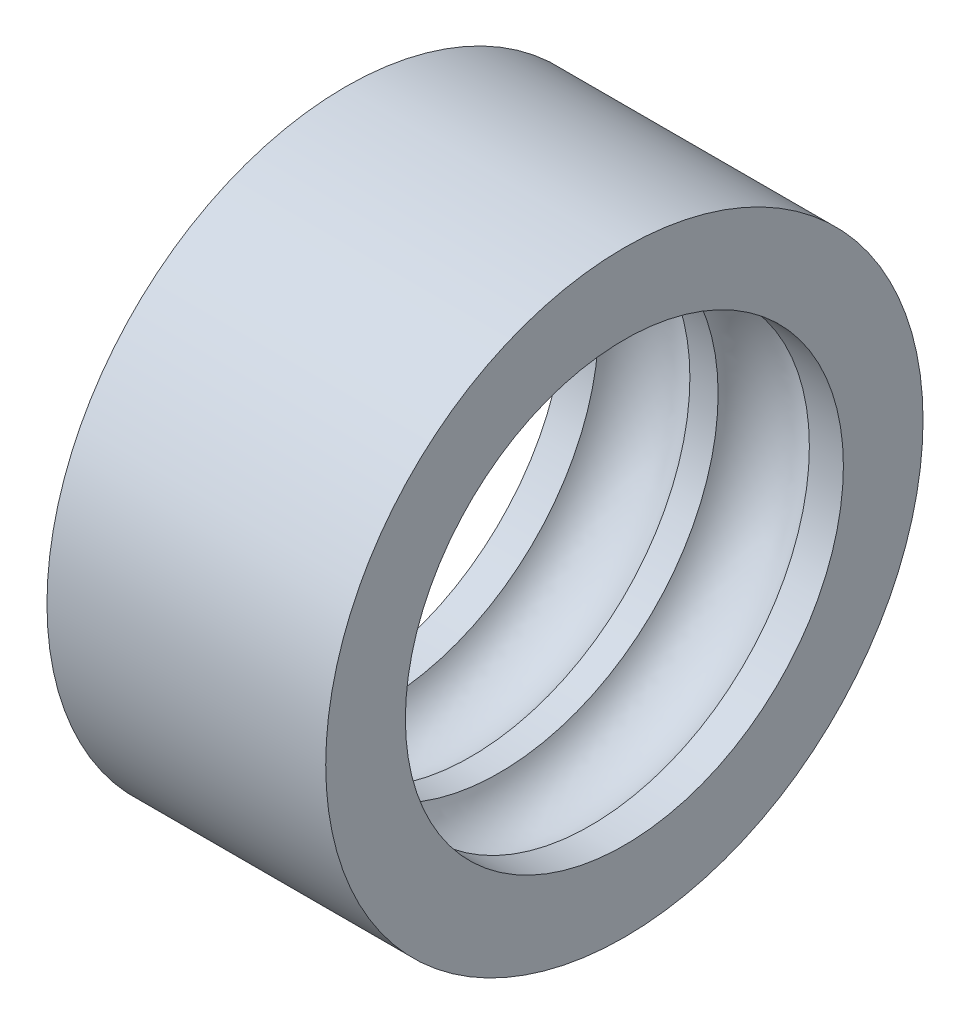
ISO-10303-21;
HEADER;
FILE_DESCRIPTION(('STEP AP214'),'2;1');
FILE_NAME('part.step','',(''),(''),'','','');
FILE_SCHEMA(('AUTOMOTIVE_DESIGN { 1 0 10303 214 1 1 1 1 }'));
ENDSEC;
DATA;
#1=APPLICATION_CONTEXT('core data for automotive mechanical design processes');
#2=APPLICATION_PROTOCOL_DEFINITION('international standard','automotive_design',2000,#1);
#3=PRODUCT_CONTEXT('',#1,'mechanical');
#4=PRODUCT('Part','Part','',(#3));
#5=PRODUCT_RELATED_PRODUCT_CATEGORY('part','',(#4));
#6=PRODUCT_DEFINITION_FORMATION('','',#4);
#7=PRODUCT_DEFINITION_CONTEXT('part definition',#1,'design');
#8=PRODUCT_DEFINITION('design','',#6,#7);
#9=PRODUCT_DEFINITION_SHAPE('','',#8);
#10=(LENGTH_UNIT() NAMED_UNIT(*) SI_UNIT(.MILLI.,.METRE.));
#11=(NAMED_UNIT(*) PLANE_ANGLE_UNIT() SI_UNIT($,.RADIAN.));
#12=(NAMED_UNIT(*) SI_UNIT($,.STERADIAN.) SOLID_ANGLE_UNIT());
#13=UNCERTAINTY_MEASURE_WITH_UNIT(LENGTH_MEASURE(1.E-05),#10,'distance_accuracy_value','');
#14=(GEOMETRIC_REPRESENTATION_CONTEXT(3) GLOBAL_UNCERTAINTY_ASSIGNED_CONTEXT((#13)) GLOBAL_UNIT_ASSIGNED_CONTEXT((#10,
#11,#12)) REPRESENTATION_CONTEXT('',''));
#15=CARTESIAN_POINT('',(0.,0.,0.));
#16=DIRECTION('',(0.,0.,1.));
#17=DIRECTION('',(1.,0.,0.));
#18=AXIS2_PLACEMENT_3D('',#15,#16,#17);
#19=CARTESIAN_POINT('',(7.7087121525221,7.2811529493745,5.2900672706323));
#20=CARTESIAN_POINT('',(6.7087121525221,9.134843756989,6.6368524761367));
#21=CARTESIAN_POINT('',(9.,9.9438607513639,7.2246377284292));
#22=CARTESIAN_POINT('',(11.291287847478,10.752877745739,7.8124229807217));
#23=CARTESIAN_POINT('',(12.291287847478,8.8991869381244,6.4656377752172));
#24=(BOUNDED_CURVE() B_SPLINE_CURVE(2,(#19,#20,#21,#22,#23),.UNSPECIFIED.,.F.,
.F.) B_SPLINE_CURVE_WITH_KNOTS((3,2,3),(0.5,0.75,1.),
.UNSPECIFIED.) CURVE() GEOMETRIC_REPRESENTATION_ITEM() RATIONAL_B_SPLINE_CURVE((1.,
0.70710678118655,1.,0.70710678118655,1.)) REPRESENTATION_ITEM(''));
#25=CARTESIAN_POINT('',(12.5,0.,0.));
#26=DIRECTION('',(-1.,0.,0.));
#27=AXIS1_PLACEMENT('',#25,#26);
#28=SURFACE_OF_REVOLUTION('',#24,#27);
#29=CARTESIAN_POINT('',(7.70871215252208,0.,0.));
#30=DIRECTION('',(-1.,0.,0.));
#31=DIRECTION('',(0.,0.,1.));
#32=AXIS2_PLACEMENT_3D('',#29,#30,#31);
#33=CIRCLE('',#32,11.);
#34=CARTESIAN_POINT('',(7.70871215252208,0.,11.));
#35=VERTEX_POINT('',#34);
#36=EDGE_CURVE('E62',#35,#35,#33,.F.);
#37=ORIENTED_EDGE('',*,*,#36,.F.);
#38=EDGE_LOOP('',(#37));
#39=FACE_BOUND('',#38,.T.);
#40=CARTESIAN_POINT('',(12.2912878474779,0.,0.));
#41=DIRECTION('',(-1.,0.,0.));
#42=DIRECTION('',(0.,0.,1.));
#43=AXIS2_PLACEMENT_3D('',#40,#41,#42);
#44=CIRCLE('',#43,11.);
#45=CARTESIAN_POINT('',(12.2912878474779,0.,11.));
#46=VERTEX_POINT('',#45);
#47=EDGE_CURVE('E68',#46,#46,#44,.T.);
#48=ORIENTED_EDGE('',*,*,#47,.F.);
#49=EDGE_LOOP('',(#48));
#50=FACE_BOUND('',#49,.T.);
#51=ADVANCED_FACE('F13',(#39,#50),#28,.T.);
#52=CARTESIAN_POINT('',(14.,0.,0.));
#53=DIRECTION('',(-1.,0.,0.));
#54=DIRECTION('',(0.,0.,1.));
#55=AXIS2_PLACEMENT_3D('',#52,#53,#54);
#56=CYLINDRICAL_SURFACE('',#55,11.);
#57=CARTESIAN_POINT('',(14.,0.,0.));
#58=DIRECTION('',(-1.,0.,0.));
#59=DIRECTION('',(0.,0.,1.));
#60=AXIS2_PLACEMENT_3D('',#57,#58,#59);
#61=CIRCLE('',#60,11.);
#62=CARTESIAN_POINT('',(14.,0.,11.));
#63=VERTEX_POINT('',#62);
#64=EDGE_CURVE('E57',#63,#63,#61,.T.);
#65=ORIENTED_EDGE('',*,*,#64,.F.);
#66=EDGE_LOOP('',(#65));
#67=FACE_BOUND('',#66,.T.);
#68=ORIENTED_EDGE('',*,*,#47,.T.);
#69=EDGE_LOOP('',(#68));
#70=FACE_BOUND('',#69,.T.);
#71=ADVANCED_FACE('F74',(#67,#70),#56,.F.);
#72=CARTESIAN_POINT('',(7.70871215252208,0.,0.));
#73=DIRECTION('',(-1.,0.,0.));
#74=DIRECTION('',(0.,0.,1.));
#75=AXIS2_PLACEMENT_3D('',#72,#73,#74);
#76=CYLINDRICAL_SURFACE('',#75,11.);
#77=ORIENTED_EDGE('',*,*,#36,.T.);
#78=EDGE_LOOP('',(#77));
#79=FACE_BOUND('',#78,.T.);
#80=CARTESIAN_POINT('',(6.29128784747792,0.,0.));
#81=DIRECTION('',(-1.,0.,0.));
#82=DIRECTION('',(0.,0.,1.));
#83=AXIS2_PLACEMENT_3D('',#80,#81,#82);
#84=CIRCLE('',#83,11.);
#85=CARTESIAN_POINT('',(6.29128784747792,0.,11.));
#86=VERTEX_POINT('',#85);
#87=EDGE_CURVE('E51',#86,#86,#84,.T.);
#88=ORIENTED_EDGE('',*,*,#87,.T.);
#89=EDGE_LOOP('',(#88));
#90=FACE_BOUND('',#89,.T.);
#91=ADVANCED_FACE('F83',(#79,#90),#76,.F.);
#92=CARTESIAN_POINT('',(14.,-3.3184761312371,-20.952033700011));
#93=DIRECTION('',(1.,0.,0.));
#94=DIRECTION('',(0.,0.809016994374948,0.587785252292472));
#95=AXIS2_PLACEMENT_3D('',#92,#93,#94);
#96=PLANE('',#95);
#97=ORIENTED_EDGE('',*,*,#64,.T.);
#98=EDGE_LOOP('',(#97));
#99=FACE_BOUND('',#98,.T.);
#100=CARTESIAN_POINT('',(14.,0.,0.));
#101=DIRECTION('',(-1.,0.,0.));
#102=DIRECTION('',(0.,0.,1.));
#103=AXIS2_PLACEMENT_3D('',#100,#101,#102);
#104=CIRCLE('',#103,14.9999999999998);
#105=CARTESIAN_POINT('',(14.,0.,14.9999999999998));
#106=VERTEX_POINT('',#105);
#107=EDGE_CURVE('E46',#106,#106,#104,.F.);
#108=ORIENTED_EDGE('',*,*,#107,.T.);
#109=EDGE_LOOP('',(#108));
#110=FACE_BOUND('',#109,.T.);
#111=ADVANCED_FACE('F105',(#99,#110),#96,.T.);
#112=CARTESIAN_POINT('',(1.7087121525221,7.2811529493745,5.2900672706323));
#113=CARTESIAN_POINT('',(0.70871215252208,9.134843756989,6.6368524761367));
#114=CARTESIAN_POINT('',(3.,9.9438607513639,7.2246377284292));
#115=CARTESIAN_POINT('',(5.2912878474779,10.752877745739,7.8124229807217));
#116=CARTESIAN_POINT('',(6.2912878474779,8.8991869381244,6.4656377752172));
#117=(BOUNDED_CURVE() B_SPLINE_CURVE(2,(#112,#113,#114,#115,#116),.UNSPECIFIED.,.F.,
.F.) B_SPLINE_CURVE_WITH_KNOTS((3,2,3),(0.5,0.75,1.),
.UNSPECIFIED.) CURVE() GEOMETRIC_REPRESENTATION_ITEM() RATIONAL_B_SPLINE_CURVE((1.,
0.70710678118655,1.,0.70710678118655,1.)) REPRESENTATION_ITEM(''));
#118=CARTESIAN_POINT('',(6.5,0.,0.));
#119=DIRECTION('',(-1.,0.,0.));
#120=AXIS1_PLACEMENT('',#118,#119);
#121=SURFACE_OF_REVOLUTION('',#117,#120);
#122=CARTESIAN_POINT('',(1.70871215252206,0.,0.));
#123=DIRECTION('',(-1.,0.,0.));
#124=DIRECTION('',(0.,0.,1.));
#125=AXIS2_PLACEMENT_3D('',#122,#123,#124);
#126=CIRCLE('',#125,11.);
#127=CARTESIAN_POINT('',(1.70871215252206,0.,11.));
#128=VERTEX_POINT('',#127);
#129=EDGE_CURVE('E31',#128,#128,#126,.F.);
#130=ORIENTED_EDGE('',*,*,#129,.F.);
#131=EDGE_LOOP('',(#130));
#132=FACE_BOUND('',#131,.T.);
#133=ORIENTED_EDGE('',*,*,#87,.F.);
#134=EDGE_LOOP('',(#133));
#135=FACE_BOUND('',#134,.T.);
#136=ADVANCED_FACE('F99',(#132,#135),#121,.T.);
#137=CARTESIAN_POINT('',(14.,0.,0.));
#138=DIRECTION('',(-1.,0.,0.));
#139=DIRECTION('',(0.,0.,1.));
#140=AXIS2_PLACEMENT_3D('',#137,#138,#139);
#141=CYLINDRICAL_SURFACE('',#140,14.9999999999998);
#142=ORIENTED_EDGE('',*,*,#107,.F.);
#143=EDGE_LOOP('',(#142));
#144=FACE_BOUND('',#143,.T.);
#145=CARTESIAN_POINT('',(0.,0.,0.));
#146=DIRECTION('',(-1.,0.,0.));
#147=DIRECTION('',(0.,0.,1.));
#148=AXIS2_PLACEMENT_3D('',#145,#146,#147);
#149=CIRCLE('',#148,14.9999999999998);
#150=CARTESIAN_POINT('',(0.,0.,14.9999999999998));
#151=VERTEX_POINT('',#150);
#152=EDGE_CURVE('E22',#151,#151,#149,.T.);
#153=ORIENTED_EDGE('',*,*,#152,.F.);
#154=EDGE_LOOP('',(#153));
#155=FACE_BOUND('',#154,.T.);
#156=ADVANCED_FACE('F92',(#144,#155),#141,.T.);
#157=CARTESIAN_POINT('',(1.70871215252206,0.,0.));
#158=DIRECTION('',(-1.,0.,0.));
#159=DIRECTION('',(0.,0.,1.));
#160=AXIS2_PLACEMENT_3D('',#157,#158,#159);
#161=CYLINDRICAL_SURFACE('',#160,11.);
#162=ORIENTED_EDGE('',*,*,#129,.T.);
#163=EDGE_LOOP('',(#162));
#164=FACE_BOUND('',#163,.T.);
#165=CARTESIAN_POINT('',(0.,0.,0.));
#166=DIRECTION('',(-1.,0.,0.));
#167=DIRECTION('',(0.,0.,1.));
#168=AXIS2_PLACEMENT_3D('',#165,#166,#167);
#169=CIRCLE('',#168,11.);
#170=CARTESIAN_POINT('',(0.,0.,11.));
#171=VERTEX_POINT('',#170);
#172=EDGE_CURVE('E9',#171,#171,#169,.F.);
#173=ORIENTED_EDGE('',*,*,#172,.F.);
#174=EDGE_LOOP('',(#173));
#175=FACE_BOUND('',#174,.T.);
#176=ADVANCED_FACE('F88',(#164,#175),#161,.F.);
#177=CARTESIAN_POINT('',(0.,-20.952033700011,3.3184761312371));
#178=DIRECTION('',(-1.,0.,0.));
#179=DIRECTION('',(0.,0.809016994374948,0.587785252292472));
#180=AXIS2_PLACEMENT_3D('',#177,#178,#179);
#181=PLANE('',#180);
#182=ORIENTED_EDGE('',*,*,#172,.T.);
#183=EDGE_LOOP('',(#182));
#184=FACE_BOUND('',#183,.T.);
#185=ORIENTED_EDGE('',*,*,#152,.T.);
#186=EDGE_LOOP('',(#185));
#187=FACE_BOUND('',#186,.T.);
#188=ADVANCED_FACE('F15',(#184,#187),#181,.T.);
#189=CLOSED_SHELL('',(#51,#71,#91,#111,#136,#156,#176,#188));
#190=MANIFOLD_SOLID_BREP('B1',#189);
#191=ADVANCED_BREP_SHAPE_REPRESENTATION('',(#18,#190),#14);
#192=SHAPE_DEFINITION_REPRESENTATION(#9,#191);
ENDSEC;
END-ISO-10303-21;
